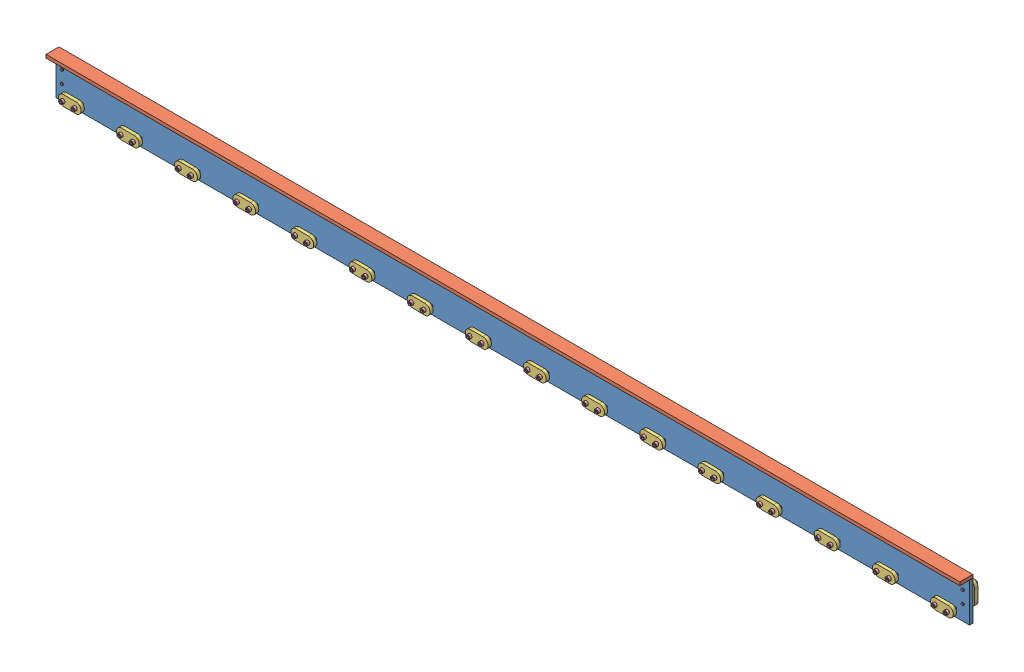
SolidWorks assembly fs-bs-angled-mount-assembly-with-screws.SLDASM, configuration Default (file format 9000). Lengths in mm.
Overall size (1784.35 82.55 44.16).
57 component instances, 4 part files, 6 mates.
Components (placement in the parent):
- fs-bs-angled-mount-assembly-1: fs-bs-angled-mount-assembly.SLDASM [Default] at origin size (1784.35 82.55 38)
  - fs-bs-angled-mount-vertical-component-1: fs-bs-angled-mount-vertical-component.SLDPRT [Default] at origin size (1784.35 76.2 6.35)
  - fs-bs-angled-mount-horizontal-component-1: fs-bs-angled-mount-horizontal-component.SLDPRT [Default] at (892.175 76.2 12.7) size (1784.35 6.35 25.4)
  - fs-clamp-1: fs-clamp.SLDPRT [Default] at (27.94 15.24 12.8007) size (44.45 20.32 6.35)
  - fs-clamp-2: fs-clamp.SLDPRT [Default] at (141.478 15.24 12.8007) size (44.45 20.32 6.35)
  - fs-clamp-3: fs-clamp.SLDPRT [Default] at (255.016 15.24 12.8007) size (44.45 20.32 6.35)
  - fs-clamp-4: fs-clamp.SLDPRT [Default] at (368.554 15.24 12.8007) size (44.45 20.32 6.35)
  - fs-clamp-5: fs-clamp.SLDPRT [Default] at (482.092 15.24 12.8007) size (44.45 20.32 6.35)
  - fs-clamp-6: fs-clamp.SLDPRT [Default] at (595.63 15.24 12.8007) size (44.45 20.32 6.35)
  - fs-clamp-7: fs-clamp.SLDPRT [Default] at (709.168 15.24 12.8007) size (44.45 20.32 6.35)
  - fs-clamp-8: fs-clamp.SLDPRT [Default] at (822.706 15.24 12.8007) size (44.45 20.32 6.35)
  - fs-clamp-9: fs-clamp.SLDPRT [Default] at (936.244 15.24 12.8007) size (44.45 20.32 6.35)
  - fs-clamp-10: fs-clamp.SLDPRT [Default] at (1049.782 15.24 12.8007) size (44.45 20.32 6.35)
  - fs-clamp-11: fs-clamp.SLDPRT [Default] at (1163.32 15.24 12.8007) size (44.45 20.32 6.35)
  - fs-clamp-12: fs-clamp.SLDPRT [Default] at (1276.858 15.24 12.8007) size (44.45 20.32 6.35)
  - fs-clamp-13: fs-clamp.SLDPRT [Default] at (1390.396 15.24 12.8007) size (44.45 20.32 6.35)
  - fs-clamp-14: fs-clamp.SLDPRT [Default] at (1503.934 15.24 12.8007) size (44.45 20.32 6.35)
  - fs-clamp-15: fs-clamp.SLDPRT [Default] at (1617.472 15.24 12.8007) size (44.45 20.32 6.35)
  - fs-clamp-16: fs-clamp.SLDPRT [Default] at (1731.01 15.24 12.8007) size (44.45 20.32 6.35)
  - fs-clamp-19: fs-clamp.SLDPRT [Default] at (12.7 53.975 -12.5735) x (0 -1 0) z (0 0 1) size (44.45 20.32 6.35)
  - fs-clamp-20: fs-clamp.SLDPRT [Default] at (1771.65 29.845 -12.5985) x (0 1 0) z (0 0 1) size (44.45 20.32 6.35)
- socket head cap screw_ai-1: socket head cap screw_ai.sldprt [HX-SHCS 0.19-32x0.875x0.875-N] at (27.94 15.24 25.0524) x (0 0 -1) z (-0.570283 0.821448 0) size (27.05 7.94 7.94)
- socket head cap screw_ai-3: socket head cap screw_ai.sldprt [HX-SHCS 0.19-32x0.875x0.875-N] at (52.07 15.24 25.3347) x (0 0 -1) z (0.61191 -0.790927 0) size (27.05 7.94 7.94)
- socket head cap screw_ai-4: socket head cap screw_ai.sldprt [HX-SHCS 0.19-32x0.875x0.875-N] at (12.7 29.845 -18.7638) x (0 0 1) z (-0.601781 -0.798661 0) size (27.05 7.94 7.94)
- socket head cap screw_ai-5: socket head cap screw_ai.sldprt [HX-SHCS 0.19-32x0.875x0.875-N] at (12.7 53.975 -18.6513) x (0 0 1) z (0.101721 0.994813 0) size (27.05 7.94 7.94)
- socket head cap screw_ai-6: socket head cap screw_ai.sldprt [HX-SHCS 0.19-32x0.875x0.875-N] at (1771.65 29.845 -18.7537) x (0 0 1) z (-0.220834 -0.975311 0) size (27.05 7.94 7.94)
- socket head cap screw_ai-7: socket head cap screw_ai.sldprt [HX-SHCS 0.19-32x0.875x0.875-N] at (1771.65 53.975 -18.662) x (0 0 1) z (-0.85708 -0.515183 0) size (27.05 7.94 7.94)
- socket head cap screw_ai-8: socket head cap screw_ai.sldprt [HX-SHCS 0.19-32x0.875x0.875-N] at (141.478 15.24 25.0524) x (0 0 -1) z (-0.570283 0.821448 0) size (27.05 7.94 7.94)
- socket head cap screw_ai-9: socket head cap screw_ai.sldprt [HX-SHCS 0.19-32x0.875x0.875-N] at (255.016 15.24 25.0524) x (0 0 -1) z (-0.570283 0.821448 0) size (27.05 7.94 7.94)
- socket head cap screw_ai-10: socket head cap screw_ai.sldprt [HX-SHCS 0.19-32x0.875x0.875-N] at (368.554 15.24 25.0524) x (0 0 -1) z (-0.570283 0.821448 0) size (27.05 7.94 7.94)
- socket head cap screw_ai-11: socket head cap screw_ai.sldprt [HX-SHCS 0.19-32x0.875x0.875-N] at (482.092 15.24 25.0524) x (0 0 -1) z (-0.570283 0.821448 0) size (27.05 7.94 7.94)
- socket head cap screw_ai-12: socket head cap screw_ai.sldprt [HX-SHCS 0.19-32x0.875x0.875-N] at (595.63 15.24 25.0524) x (0 0 -1) z (-0.570283 0.821448 0) size (27.05 7.94 7.94)
- socket head cap screw_ai-13: socket head cap screw_ai.sldprt [HX-SHCS 0.19-32x0.875x0.875-N] at (709.168 15.24 25.0524) x (0 0 -1) z (-0.570283 0.821448 0) size (27.05 7.94 7.94)
- socket head cap screw_ai-14: socket head cap screw_ai.sldprt [HX-SHCS 0.19-32x0.875x0.875-N] at (822.706 15.24 25.0524) x (0 0 -1) z (-0.570283 0.821448 0) size (27.05 7.94 7.94)
- socket head cap screw_ai-15: socket head cap screw_ai.sldprt [HX-SHCS 0.19-32x0.875x0.875-N] at (936.244 15.24 25.0524) x (0 0 -1) z (-0.570283 0.821448 0) size (27.05 7.94 7.94)
- socket head cap screw_ai-16: socket head cap screw_ai.sldprt [HX-SHCS 0.19-32x0.875x0.875-N] at (1049.782 15.24 25.0524) x (0 0 -1) z (-0.570283 0.821448 0) size (27.05 7.94 7.94)
- socket head cap screw_ai-17: socket head cap screw_ai.sldprt [HX-SHCS 0.19-32x0.875x0.875-N] at (1163.32 15.24 25.0524) x (0 0 -1) z (-0.570283 0.821448 0) size (27.05 7.94 7.94)
- socket head cap screw_ai-18: socket head cap screw_ai.sldprt [HX-SHCS 0.19-32x0.875x0.875-N] at (1276.858 15.24 25.0524) x (0 0 -1) z (-0.570283 0.821448 0) size (27.05 7.94 7.94)
- socket head cap screw_ai-19: socket head cap screw_ai.sldprt [HX-SHCS 0.19-32x0.875x0.875-N] at (1390.396 15.24 25.0524) x (0 0 -1) z (-0.570283 0.821448 0) size (27.05 7.94 7.94)
- socket head cap screw_ai-20: socket head cap screw_ai.sldprt [HX-SHCS 0.19-32x0.875x0.875-N] at (1503.934 15.24 25.0524) x (0 0 -1) z (-0.570283 0.821448 0) size (27.05 7.94 7.94)
- socket head cap screw_ai-21: socket head cap screw_ai.sldprt [HX-SHCS 0.19-32x0.875x0.875-N] at (1617.472 15.24 25.0524) x (0 0 -1) z (-0.570283 0.821448 0) size (27.05 7.94 7.94)
- socket head cap screw_ai-22: socket head cap screw_ai.sldprt [HX-SHCS 0.19-32x0.875x0.875-N] at (1731.01 15.24 25.0524) x (0 0 -1) z (-0.570283 0.821448 0) size (27.05 7.94 7.94)
- socket head cap screw_ai-25: socket head cap screw_ai.sldprt [HX-SHCS 0.19-32x0.875x0.875-N] at (165.608 15.24 25.3347) x (0 0 -1) z (0.61191 -0.790927 0) size (27.05 7.94 7.94)
- socket head cap screw_ai-26: socket head cap screw_ai.sldprt [HX-SHCS 0.19-32x0.875x0.875-N] at (279.146 15.24 25.3347) x (0 0 -1) z (0.61191 -0.790927 0) size (27.05 7.94 7.94)
- socket head cap screw_ai-27: socket head cap screw_ai.sldprt [HX-SHCS 0.19-32x0.875x0.875-N] at (392.684 15.24 25.3347) x (0 0 -1) z (0.61191 -0.790927 0) size (27.05 7.94 7.94)
- socket head cap screw_ai-28: socket head cap screw_ai.sldprt [HX-SHCS 0.19-32x0.875x0.875-N] at (506.222 15.24 25.3347) x (0 0 -1) z (0.61191 -0.790927 0) size (27.05 7.94 7.94)
- socket head cap screw_ai-29: socket head cap screw_ai.sldprt [HX-SHCS 0.19-32x0.875x0.875-N] at (619.76 15.24 25.3347) x (0 0 -1) z (0.61191 -0.790927 0) size (27.05 7.94 7.94)
- socket head cap screw_ai-30: socket head cap screw_ai.sldprt [HX-SHCS 0.19-32x0.875x0.875-N] at (733.298 15.24 25.3347) x (0 0 -1) z (0.61191 -0.790927 0) size (27.05 7.94 7.94)
- socket head cap screw_ai-31: socket head cap screw_ai.sldprt [HX-SHCS 0.19-32x0.875x0.875-N] at (846.836 15.24 25.3347) x (0 0 -1) z (0.61191 -0.790927 0) size (27.05 7.94 7.94)
- socket head cap screw_ai-32: socket head cap screw_ai.sldprt [HX-SHCS 0.19-32x0.875x0.875-N] at (960.374 15.24 25.3347) x (0 0 -1) z (0.61191 -0.790927 0) size (27.05 7.94 7.94)
- socket head cap screw_ai-33: socket head cap screw_ai.sldprt [HX-SHCS 0.19-32x0.875x0.875-N] at (1073.912 15.24 25.3347) x (0 0 -1) z (0.61191 -0.790927 0) size (27.05 7.94 7.94)
- socket head cap screw_ai-34: socket head cap screw_ai.sldprt [HX-SHCS 0.19-32x0.875x0.875-N] at (1187.45 15.24 25.3347) x (0 0 -1) z (0.61191 -0.790927 0) size (27.05 7.94 7.94)
- socket head cap screw_ai-35: socket head cap screw_ai.sldprt [HX-SHCS 0.19-32x0.875x0.875-N] at (1300.988 15.24 25.3347) x (0 0 -1) z (0.61191 -0.790927 0) size (27.05 7.94 7.94)
- socket head cap screw_ai-36: socket head cap screw_ai.sldprt [HX-SHCS 0.19-32x0.875x0.875-N] at (1414.526 15.24 25.3347) x (0 0 -1) z (0.61191 -0.790927 0) size (27.05 7.94 7.94)
- socket head cap screw_ai-37: socket head cap screw_ai.sldprt [HX-SHCS 0.19-32x0.875x0.875-N] at (1528.064 15.24 25.3347) x (0 0 -1) z (0.61191 -0.790927 0) size (27.05 7.94 7.94)
- socket head cap screw_ai-38: socket head cap screw_ai.sldprt [HX-SHCS 0.19-32x0.875x0.875-N] at (1641.602 15.24 25.3347) x (0 0 -1) z (0.61191 -0.790927 0) size (27.05 7.94 7.94)
- socket head cap screw_ai-39: socket head cap screw_ai.sldprt [HX-SHCS 0.19-32x0.875x0.875-N] at (1755.14 15.24 25.3347) x (0 0 -1) z (0.61191 -0.790927 0) size (27.05 7.94 7.94)
Mates (geometry in assembly coordinates):
- Concentric1: concentric anti-aligned: cylinder of fs-bs-angled-mount-assembly-1/fs-clamp-1 through (27.94 15.24 19.1507) axis (0 0 -1) radius 2.54; cylinder of socket head cap screw_ai-1 through (27.94 15.24 56.8024) axis (0 0 1) radius 2.413
- Concentric2: concentric anti-aligned: cylinder of fs-bs-angled-mount-assembly-1/fs-clamp-1 through (52.07 15.24 19.1507) axis (0 0 -1) radius 2.54; cylinder of socket head cap screw_ai-3 through (52.07 15.24 57.0847) axis (0 0 1) radius 2.413
- Concentric3: concentric aligned: cylinder of fs-bs-angled-mount-assembly-1/fs-clamp-20 through (1771.65 53.975 -6.2485) axis (0 0 -1) radius 2.54; cylinder of socket head cap screw_ai-7 through (1771.65 53.975 -50.412) axis (0 0 -1) radius 2.413
- Concentric4: concentric aligned: cylinder of fs-bs-angled-mount-assembly-1/fs-clamp-20 through (1771.65 29.845 -6.2485) axis (0 0 -1) radius 2.54; cylinder of socket head cap screw_ai-6 through (1771.65 29.845 -50.5037) axis (0 0 -1) radius 2.413
- Concentric5: concentric aligned: cylinder of fs-bs-angled-mount-assembly-1/fs-clamp-19 through (12.7 53.975 -6.2235) axis (0 0 -1) radius 2.54; cylinder of socket head cap screw_ai-5 through (12.7 53.975 -50.4013) axis (0 0 -1) radius 2.413
- Concentric6: concentric aligned: cylinder of fs-bs-angled-mount-assembly-1/fs-clamp-19 through (12.7 29.845 -6.2235) axis (0 0 -1) radius 2.54; cylinder of socket head cap screw_ai-4 through (12.7 29.845 -50.5138) axis (0 0 -1) radius 2.413
